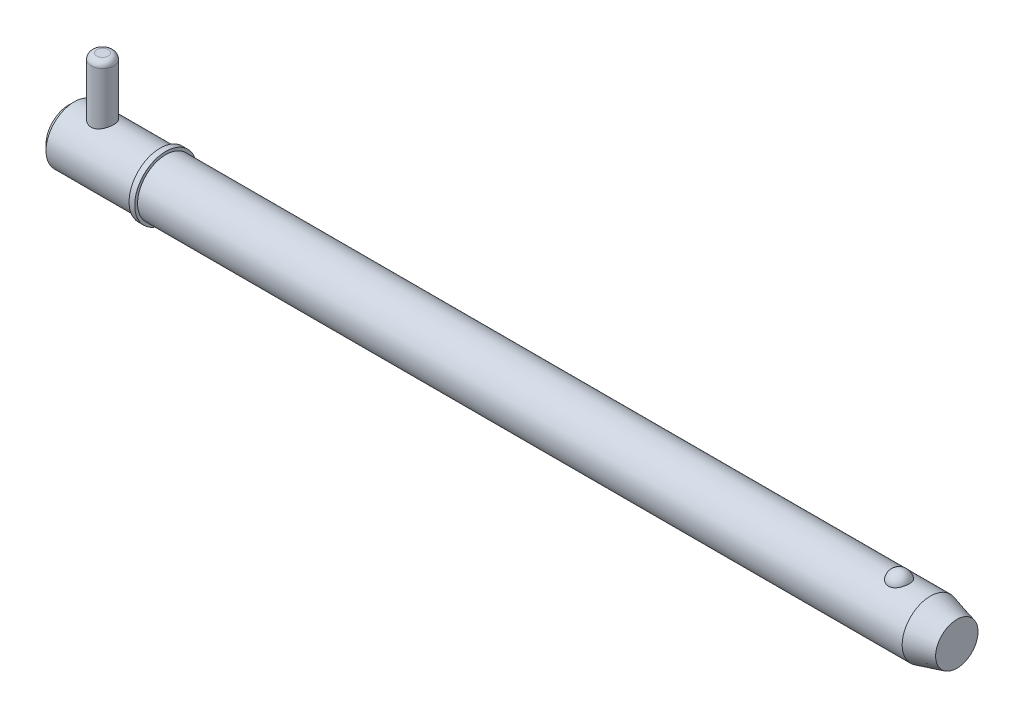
ISO-10303-21;
HEADER;
FILE_DESCRIPTION(('STEP AP214'),'2;1');
FILE_NAME('part.step','',(''),(''),'','','');
FILE_SCHEMA(('AUTOMOTIVE_DESIGN { 1 0 10303 214 1 1 1 1 }'));
ENDSEC;
DATA;
#1=APPLICATION_CONTEXT('core data for automotive mechanical design processes');
#2=APPLICATION_PROTOCOL_DEFINITION('international standard','automotive_design',2000,#1);
#3=PRODUCT_CONTEXT('',#1,'mechanical');
#4=PRODUCT('Part','Part','',(#3));
#5=PRODUCT_RELATED_PRODUCT_CATEGORY('part','',(#4));
#6=PRODUCT_DEFINITION_FORMATION('','',#4);
#7=PRODUCT_DEFINITION_CONTEXT('part definition',#1,'design');
#8=PRODUCT_DEFINITION('design','',#6,#7);
#9=PRODUCT_DEFINITION_SHAPE('','',#8);
#10=(LENGTH_UNIT() NAMED_UNIT(*) SI_UNIT(.MILLI.,.METRE.));
#11=(NAMED_UNIT(*) PLANE_ANGLE_UNIT() SI_UNIT($,.RADIAN.));
#12=(NAMED_UNIT(*) SI_UNIT($,.STERADIAN.) SOLID_ANGLE_UNIT());
#13=UNCERTAINTY_MEASURE_WITH_UNIT(LENGTH_MEASURE(1.E-05),#10,'distance_accuracy_value','');
#14=(GEOMETRIC_REPRESENTATION_CONTEXT(3) GLOBAL_UNCERTAINTY_ASSIGNED_CONTEXT((#13)) GLOBAL_UNIT_ASSIGNED_CONTEXT((#10,
#11,#12)) REPRESENTATION_CONTEXT('',''));
#15=CARTESIAN_POINT('',(0.,0.,0.));
#16=DIRECTION('',(0.,0.,1.));
#17=DIRECTION('',(1.,0.,0.));
#18=AXIS2_PLACEMENT_3D('',#15,#16,#17);
#19=CARTESIAN_POINT('',(9.525,23.81,0.));
#20=DIRECTION('',(0.,-1.,0.));
#21=DIRECTION('',(0.,0.,-1.));
#22=AXIS2_PLACEMENT_3D('',#19,#20,#21);
#23=CYLINDRICAL_SURFACE('',#22,3.175);
#24=CARTESIAN_POINT('',(9.525,-6.3525,0.));
#25=DIRECTION('',(0.,1.,0.));
#26=DIRECTION('',(0.,0.,1.));
#27=AXIS2_PLACEMENT_3D('',#24,#25,#26);
#28=CIRCLE('',#27,3.175);
#29=CARTESIAN_POINT('',(9.525,-6.3525,3.175));
#30=VERTEX_POINT('',#29);
#31=EDGE_CURVE('P0_E25',#30,#30,#28,.T.);
#32=ORIENTED_EDGE('',*,*,#31,.T.);
#33=EDGE_LOOP('',(#32));
#34=FACE_BOUND('',#33,.T.);
#35=CARTESIAN_POINT('',(9.525,22.2225,0.));
#36=DIRECTION('',(0.,1.,0.));
#37=DIRECTION('',(0.,0.,1.));
#38=AXIS2_PLACEMENT_3D('',#35,#36,#37);
#39=CIRCLE('',#38,3.175);
#40=CARTESIAN_POINT('',(9.525,22.2225,3.175));
#41=VERTEX_POINT('',#40);
#42=EDGE_CURVE('P0_E29',#41,#41,#39,.F.);
#43=ORIENTED_EDGE('',*,*,#42,.T.);
#44=EDGE_LOOP('',(#43));
#45=FACE_BOUND('',#44,.T.);
#46=ADVANCED_FACE('P0_F14',(#34,#45),#23,.T.);
#47=CARTESIAN_POINT('',(9.525,23.81,0.));
#48=DIRECTION('',(0.,1.,0.));
#49=DIRECTION('',(0.,0.,1.));
#50=AXIS2_PLACEMENT_3D('',#47,#48,#49);
#51=PLANE('',#50);
#52=CARTESIAN_POINT('',(9.525,23.81,0.));
#53=DIRECTION('',(0.,1.,0.));
#54=DIRECTION('',(0.,0.,1.));
#55=AXIS2_PLACEMENT_3D('',#52,#53,#54);
#56=CIRCLE('',#55,1.5875);
#57=CARTESIAN_POINT('',(9.525,23.81,1.5875));
#58=VERTEX_POINT('',#57);
#59=EDGE_CURVE('P0_E10',#58,#58,#56,.T.);
#60=ORIENTED_EDGE('',*,*,#59,.T.);
#61=EDGE_LOOP('',(#60));
#62=FACE_BOUND('',#61,.T.);
#63=ADVANCED_FACE('P0_F46',(#62),#51,.T.);
#64=CARTESIAN_POINT('',(9.525,-7.94,0.));
#65=DIRECTION('',(0.,1.,0.));
#66=DIRECTION('',(0.,0.,1.));
#67=AXIS2_PLACEMENT_3D('',#64,#65,#66);
#68=PLANE('',#67);
#69=CARTESIAN_POINT('',(9.525,-7.94,0.));
#70=DIRECTION('',(0.,1.,0.));
#71=DIRECTION('',(0.,0.,1.));
#72=AXIS2_PLACEMENT_3D('',#69,#70,#71);
#73=CIRCLE('',#72,1.5875);
#74=CARTESIAN_POINT('',(9.525,-7.94,1.5875));
#75=VERTEX_POINT('',#74);
#76=EDGE_CURVE('P0_E21',#75,#75,#73,.F.);
#77=ORIENTED_EDGE('',*,*,#76,.T.);
#78=EDGE_LOOP('',(#77));
#79=FACE_BOUND('',#78,.T.);
#80=ADVANCED_FACE('P0_F43',(#79),#68,.F.);
#81=CARTESIAN_POINT('',(9.525,-6.3525,0.));
#82=DIRECTION('',(0.,1.,0.));
#83=DIRECTION('',(0.,0.,1.));
#84=AXIS2_PLACEMENT_3D('',#81,#82,#83);
#85=DEGENERATE_TOROIDAL_SURFACE('',#84,1.5875,1.5875,.T.);
#86=ORIENTED_EDGE('',*,*,#76,.F.);
#87=EDGE_LOOP('',(#86));
#88=FACE_BOUND('',#87,.T.);
#89=ORIENTED_EDGE('',*,*,#31,.F.);
#90=EDGE_LOOP('',(#89));
#91=FACE_BOUND('',#90,.T.);
#92=ADVANCED_FACE('P0_F38',(#88,#91),#85,.T.);
#93=CARTESIAN_POINT('',(9.525,22.2225,0.));
#94=DIRECTION('',(0.,1.,0.));
#95=DIRECTION('',(0.,0.,1.));
#96=AXIS2_PLACEMENT_3D('',#93,#94,#95);
#97=DEGENERATE_TOROIDAL_SURFACE('',#96,1.5875,1.5875,.T.);
#98=ORIENTED_EDGE('',*,*,#42,.F.);
#99=EDGE_LOOP('',(#98));
#100=FACE_BOUND('',#99,.T.);
#101=ORIENTED_EDGE('',*,*,#59,.F.);
#102=EDGE_LOOP('',(#101));
#103=FACE_BOUND('',#102,.T.);
#104=ADVANCED_FACE('P0_F16',(#100,#103),#97,.T.);
#105=CLOSED_SHELL('',(#46,#63,#80,#92,#104));
#106=MANIFOLD_SOLID_BREP('P0_B1',#105);
#107=CARTESIAN_POINT('',(0.,0.,0.));
#108=DIRECTION('',(1.,0.,0.));
#109=DIRECTION('',(0.,0.,-1.));
#110=AXIS2_PLACEMENT_3D('',#107,#108,#109);
#111=CYLINDRICAL_SURFACE('',#110,7.94);
#112=CARTESIAN_POINT('',(242.151879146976,0.,0.));
#113=DIRECTION('',(1.,0.,0.));
#114=DIRECTION('',(0.,0.,-1.));
#115=AXIS2_PLACEMENT_3D('',#112,#113,#114);
#116=CIRCLE('',#115,7.94);
#117=CARTESIAN_POINT('',(242.151879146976,0.,-7.94));
#118=VERTEX_POINT('',#117);
#119=EDGE_CURVE('P1_E81',#118,#118,#116,.T.);
#120=ORIENTED_EDGE('',*,*,#119,.F.);
#121=EDGE_LOOP('',(#120));
#122=FACE_BOUND('',#121,.T.);
#123=CARTESIAN_POINT('',(27.31,0.,0.));
#124=DIRECTION('',(1.,0.,0.));
#125=DIRECTION('',(0.,0.,-1.));
#126=AXIS2_PLACEMENT_3D('',#123,#124,#125);
#127=CIRCLE('',#126,7.94);
#128=CARTESIAN_POINT('',(27.31,0.,-7.94));
#129=VERTEX_POINT('',#128);
#130=EDGE_CURVE('P1_E85',#129,#129,#127,.T.);
#131=ORIENTED_EDGE('',*,*,#130,.T.);
#132=EDGE_LOOP('',(#131));
#133=FACE_BOUND('',#132,.T.);
#134=CARTESIAN_POINT('',(233.344907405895,7.37767842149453,2.93486986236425));
#135=CARTESIAN_POINT('',(233.192749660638,7.37767329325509,2.93487505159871));
#136=CARTESIAN_POINT('',(233.040632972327,7.38258419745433,2.92262454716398));
#137=CARTESIAN_POINT('',(232.740928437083,7.40163229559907,2.87404196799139));
#138=CARTESIAN_POINT('',(232.593339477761,7.41576720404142,2.83771585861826));
#139=CARTESIAN_POINT('',(232.307018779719,7.45161576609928,2.74218769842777));
#140=CARTESIAN_POINT('',(232.168274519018,7.47331841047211,2.68301886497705));
#141=CARTESIAN_POINT('',(231.902882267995,7.52194082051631,2.54350967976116));
#142=CARTESIAN_POINT('',(231.776236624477,7.54886159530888,2.463165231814));
#143=CARTESIAN_POINT('',(231.534534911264,7.60594671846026,2.28090375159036));
#144=CARTESIAN_POINT('',(231.419906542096,7.63618114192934,2.17844211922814));
#145=CARTESIAN_POINT('',(231.208878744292,7.6961404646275,1.956084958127));
#146=CARTESIAN_POINT('',(231.112482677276,7.72586526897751,1.8361862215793));
#147=CARTESIAN_POINT('',(230.935938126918,7.78314821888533,1.5762808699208));
#148=CARTESIAN_POINT('',(230.856707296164,7.81055035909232,1.43561546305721));
#149=CARTESIAN_POINT('',(230.721797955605,7.85879631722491,1.14236334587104));
#150=CARTESIAN_POINT('',(230.666121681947,7.87963951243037,0.989775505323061));
#151=CARTESIAN_POINT('',(230.57881215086,7.91289645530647,0.674619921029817));
#152=CARTESIAN_POINT('',(230.54753090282,7.92518652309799,0.511941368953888));
#153=CARTESIAN_POINT('',(230.510975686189,7.93958930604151,0.183247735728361));
#154=CARTESIAN_POINT('',(230.505701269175,7.94170219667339,0.0172327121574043));
#155=CARTESIAN_POINT('',(230.521231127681,7.93554931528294,-0.312672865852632));
#156=CARTESIAN_POINT('',(230.541925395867,7.92732732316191,-0.476569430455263));
#157=CARTESIAN_POINT('',(230.60878655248,7.90141534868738,-0.7983052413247));
#158=CARTESIAN_POINT('',(230.654953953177,7.88372517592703,-0.956144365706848));
#159=CARTESIAN_POINT('',(230.771898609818,7.84066230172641,-1.26152073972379));
#160=CARTESIAN_POINT('',(230.842704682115,7.81528060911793,-1.40904568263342));
#161=CARTESIAN_POINT('',(231.007478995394,7.75948672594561,-1.68950598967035));
#162=CARTESIAN_POINT('',(231.101448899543,7.72907417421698,-1.82244030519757));
#163=CARTESIAN_POINT('',(231.310839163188,7.66640424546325,-2.07032792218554));
#164=CARTESIAN_POINT('',(231.426315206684,7.63414223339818,-2.1852330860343));
#165=CARTESIAN_POINT('',(231.6759006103,7.57149681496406,-2.39329737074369));
#166=CARTESIAN_POINT('',(231.810008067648,7.54111321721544,-2.48645870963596));
#167=CARTESIAN_POINT('',(232.090111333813,7.48650742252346,-2.64628132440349));
#168=CARTESIAN_POINT('',(232.235760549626,7.46215900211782,-2.71350554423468));
#169=CARTESIAN_POINT('',(232.537425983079,7.42171253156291,-2.82226614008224));
#170=CARTESIAN_POINT('',(232.693438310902,7.40561140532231,-2.86381209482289));
#171=CARTESIAN_POINT('',(233.002970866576,7.38426796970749,-2.91839077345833));
#172=CARTESIAN_POINT('',(233.156222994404,7.37852109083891,-2.93275024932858));
#173=CARTESIAN_POINT('',(233.463070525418,7.37700973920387,-2.93655208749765));
#174=CARTESIAN_POINT('',(233.616665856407,7.38124333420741,-2.925999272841));
#175=CARTESIAN_POINT('',(233.914990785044,7.39890635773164,-2.88102897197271));
#176=CARTESIAN_POINT('',(234.059848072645,7.41205491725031,-2.84733999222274));
#177=CARTESIAN_POINT('',(234.34164329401,7.44580110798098,-2.75788206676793));
#178=CARTESIAN_POINT('',(234.478580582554,7.46639934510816,-2.70211132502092));
#179=CARTESIAN_POINT('',(234.744061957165,7.51339098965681,-2.56858908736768));
#180=CARTESIAN_POINT('',(234.872354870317,7.5399020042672,-2.49038067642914));
#181=CARTESIAN_POINT('',(235.114244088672,7.59569503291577,-2.31462737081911));
#182=CARTESIAN_POINT('',(235.227837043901,7.62497767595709,-2.21707808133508));
#183=CARTESIAN_POINT('',(235.44322156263,7.68489473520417,-1.99982049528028));
#184=CARTESIAN_POINT('',(235.544148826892,7.7155241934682,-1.8792533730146));
#185=CARTESIAN_POINT('',(235.725186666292,7.77353016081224,-1.62268826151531));
#186=CARTESIAN_POINT('',(235.805293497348,7.80090608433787,-1.48668750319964));
#187=CARTESIAN_POINT('',(235.945361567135,7.85047992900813,-1.19818413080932));
#188=CARTESIAN_POINT('',(236.004587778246,7.87248183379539,-1.04529016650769));
#189=CARTESIAN_POINT('',(236.097982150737,7.90785114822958,-0.731080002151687));
#190=CARTESIAN_POINT('',(236.132149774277,7.92121837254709,-0.569763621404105));
#191=CARTESIAN_POINT('',(236.174795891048,7.93797834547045,-0.242812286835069));
#192=CARTESIAN_POINT('',(236.183204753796,7.94134405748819,-0.0771668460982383));
#193=CARTESIAN_POINT('',(236.173962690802,7.93767937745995,0.253276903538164));
#194=CARTESIAN_POINT('',(236.156312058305,7.93064910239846,0.418075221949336));
#195=CARTESIAN_POINT('',(236.095424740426,7.90695571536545,0.741525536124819));
#196=CARTESIAN_POINT('',(236.052281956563,7.8903279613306,0.900197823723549));
#197=CARTESIAN_POINT('',(235.94135358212,7.84916386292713,1.20759654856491));
#198=CARTESIAN_POINT('',(235.87356656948,7.82462706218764,1.35632241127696));
#199=CARTESIAN_POINT('',(235.714371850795,7.77006699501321,1.64032869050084));
#200=CARTESIAN_POINT('',(235.622861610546,7.74002008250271,1.7755471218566));
#201=CARTESIAN_POINT('',(235.418296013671,7.67774175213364,2.0280064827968));
#202=CARTESIAN_POINT('',(235.305241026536,7.64551037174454,2.14524772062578));
#203=CARTESIAN_POINT('',(235.060831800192,7.58265895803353,2.35778002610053));
#204=CARTESIAN_POINT('',(234.929583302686,7.5520309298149,2.45319004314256));
#205=CARTESIAN_POINT('',(234.651601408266,7.49579792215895,2.61999897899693));
#206=CARTESIAN_POINT('',(234.504867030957,7.47019326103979,2.69139637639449));
#207=CARTESIAN_POINT('',(234.192947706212,7.42622216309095,2.81053241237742));
#208=CARTESIAN_POINT('',(234.027220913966,7.40825002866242,2.85700910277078));
#209=CARTESIAN_POINT('',(233.689279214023,7.38398348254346,2.91916850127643));
#210=CARTESIAN_POINT('',(233.51706702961,7.37768422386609,2.93486399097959));
#211=CARTESIAN_POINT('',(233.344907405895,7.37767842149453,2.93486986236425));
#212=B_SPLINE_CURVE_WITH_KNOTS('',3,(#134,#135,#136,#137,#138,#139,#140,#141,#142,#143,#144,
#145,#146,#147,#148,#149,#150,#151,#152,#153,#154,#155,#156,#157,#158,#159,#160,#161,#162,#163,
#164,#165,#166,#167,#168,#169,#170,#171,#172,#173,#174,#175,#176,#177,#178,#179,#180,#181,#182,
#183,#184,#185,#186,#187,#188,#189,#190,#191,#192,#193,#194,#195,#196,#197,#198,#199,#200,#201,
#202,#203,#204,#205,#206,#207,#208,#209,#210,#211),.UNSPECIFIED.,.T.,.F.,(4,2,2,2,2,2,2,2,2,2,2,
2,2,2,2,2,2,2,2,2,2,2,2,2,2,2,2,2,2,2,2,2,2,2,2,2,2,2,4),(0.,0.455841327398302,
0.911569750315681,1.36663794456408,1.82179423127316,2.28978983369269,2.75787163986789,
3.24685368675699,3.73588214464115,4.23184282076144,4.7277949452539,5.22165321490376,
5.71552141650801,6.20996917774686,6.70445245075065,7.20023431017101,7.69596557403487,
8.1802341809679,8.6643220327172,9.12410697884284,9.58380291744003,10.0296503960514,
10.475534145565,10.9312349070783,11.3870393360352,11.8654416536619,12.3439299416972,
12.8378875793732,13.3318558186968,13.8271581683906,14.3224549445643,14.8159385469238,
15.3094506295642,15.8051323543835,16.3008055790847,16.7937101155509,17.2866458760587,
17.8026240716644,18.3183879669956),.UNSPECIFIED.);
#213=CARTESIAN_POINT('',(233.344907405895,7.37767842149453,2.93486986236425));
#214=VERTEX_POINT('',#213);
#215=EDGE_CURVE('P1_E35',#214,#214,#212,.T.);
#216=ORIENTED_EDGE('',*,*,#215,.T.);
#217=EDGE_LOOP('',(#216));
#218=FACE_BOUND('',#217,.T.);
#219=ADVANCED_FACE('P1_F13',(#122,#133,#218),#111,.T.);
#220=CARTESIAN_POINT('',(0.,0.,0.));
#221=DIRECTION('',(-1.,0.,0.));
#222=DIRECTION('',(0.,0.,1.));
#223=AXIS2_PLACEMENT_3D('',#220,#221,#222);
#224=PLANE('',#223);
#225=CARTESIAN_POINT('',(0.,0.,0.));
#226=DIRECTION('',(1.,0.,0.));
#227=DIRECTION('',(0.,0.,-1.));
#228=AXIS2_PLACEMENT_3D('',#225,#226,#227);
#229=CIRCLE('',#228,6.352);
#230=CARTESIAN_POINT('',(0.,0.,-6.352));
#231=VERTEX_POINT('',#230);
#232=EDGE_CURVE('P1_E9',#231,#231,#229,.T.);
#233=ORIENTED_EDGE('',*,*,#232,.F.);
#234=EDGE_LOOP('',(#233));
#235=FACE_BOUND('',#234,.T.);
#236=ADVANCED_FACE('P1_F15',(#235),#224,.T.);
#237=CARTESIAN_POINT('',(1.58799999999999,0.,0.));
#238=DIRECTION('',(1.,0.,0.));
#239=DIRECTION('',(0.,0.,-1.));
#240=AXIS2_PLACEMENT_3D('',#237,#238,#239);
#241=CONICAL_SURFACE('',#240,7.94,0.78539816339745);
#242=ORIENTED_EDGE('',*,*,#232,.T.);
#243=EDGE_LOOP('',(#242));
#244=FACE_BOUND('',#243,.T.);
#245=CARTESIAN_POINT('',(1.58799999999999,0.,0.));
#246=DIRECTION('',(1.,0.,0.));
#247=DIRECTION('',(0.,0.,-1.));
#248=AXIS2_PLACEMENT_3D('',#245,#246,#247);
#249=CIRCLE('',#248,7.94);
#250=CARTESIAN_POINT('',(1.58799999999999,0.,-7.94));
#251=VERTEX_POINT('',#250);
#252=EDGE_CURVE('P1_E26',#251,#251,#249,.T.);
#253=ORIENTED_EDGE('',*,*,#252,.F.);
#254=EDGE_LOOP('',(#253));
#255=FACE_BOUND('',#254,.T.);
#256=ADVANCED_FACE('P1_F77',(#244,#255),#241,.T.);
#257=CARTESIAN_POINT('',(0.,0.,0.));
#258=DIRECTION('',(1.,0.,0.));
#259=DIRECTION('',(0.,0.,-1.));
#260=AXIS2_PLACEMENT_3D('',#257,#258,#259);
#261=CYLINDRICAL_SURFACE('',#260,7.94);
#262=CARTESIAN_POINT('',(9.525,-7.27756655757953,3.175));
#263=CARTESIAN_POINT('',(9.43992346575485,-7.27756715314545,3.17499935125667));
#264=CARTESIAN_POINT('',(9.35481882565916,-7.27906496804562,3.1715736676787));
#265=CARTESIAN_POINT('',(9.18524505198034,-7.28499816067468,3.15791803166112));
#266=CARTESIAN_POINT('',(9.100776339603,-7.28943533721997,3.14768391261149));
#267=CARTESIAN_POINT('',(8.84895715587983,-7.30698881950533,3.10684226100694));
#268=CARTESIAN_POINT('',(8.6834173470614,-7.32434654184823,3.06609574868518));
#269=CARTESIAN_POINT('',(8.36278910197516,-7.36806950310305,2.95945910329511));
#270=CARTESIAN_POINT('',(8.20766386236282,-7.39440078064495,2.89366366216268));
#271=CARTESIAN_POINT('',(7.91065319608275,-7.45304562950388,2.73907413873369));
#272=CARTESIAN_POINT('',(7.76876488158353,-7.48535789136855,2.65028508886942));
#273=CARTESIAN_POINT('',(7.49411086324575,-7.55439482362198,2.44679888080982));
#274=CARTESIAN_POINT('',(7.36219910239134,-7.59126138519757,2.33099745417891));
#275=CARTESIAN_POINT('',(7.11904234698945,-7.66408045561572,2.07909838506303));
#276=CARTESIAN_POINT('',(7.00780457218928,-7.70003264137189,1.94299368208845));
#277=CARTESIAN_POINT('',(6.80492173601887,-7.76867514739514,1.64775981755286));
#278=CARTESIAN_POINT('',(6.71422139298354,-7.80118112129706,1.48793473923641));
#279=CARTESIAN_POINT('',(6.56135788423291,-7.85754918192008,1.15376269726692));
#280=CARTESIAN_POINT('',(6.49918311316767,-7.88141478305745,0.979421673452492));
#281=CARTESIAN_POINT('',(6.40818142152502,-7.91680873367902,0.630115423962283));
#282=CARTESIAN_POINT('',(6.3778864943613,-7.9288781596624,0.455588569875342));
#283=CARTESIAN_POINT('',(6.34677743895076,-7.94127547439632,0.103539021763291));
#284=CARTESIAN_POINT('',(6.34595232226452,-7.94160773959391,-0.0739825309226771));
#285=CARTESIAN_POINT('',(6.37300128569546,-7.93082261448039,-0.416371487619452));
#286=CARTESIAN_POINT('',(6.39926693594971,-7.92034690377,-0.581389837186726));
#287=CARTESIAN_POINT('',(6.47701615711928,-7.88998770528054,-0.904449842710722));
#288=CARTESIAN_POINT('',(6.52850157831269,-7.87010352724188,-1.06249098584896));
#289=CARTESIAN_POINT('',(6.65586120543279,-7.82249343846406,-1.36995769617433));
#290=CARTESIAN_POINT('',(6.73209124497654,-7.79465387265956,-1.51921754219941));
#291=CARTESIAN_POINT('',(6.90644286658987,-7.73389606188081,-1.80321183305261));
#292=CARTESIAN_POINT('',(7.00457194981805,-7.70097607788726,-1.93794127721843));
#293=CARTESIAN_POINT('',(7.22744086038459,-7.63084889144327,-2.19843606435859));
#294=CARTESIAN_POINT('',(7.35350432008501,-7.59350211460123,-2.3230330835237));
#295=CARTESIAN_POINT('',(7.62488266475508,-7.52039654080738,-2.54979642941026));
#296=CARTESIAN_POINT('',(7.77020381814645,-7.48463826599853,-2.65195542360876));
#297=CARTESIAN_POINT('',(8.08119298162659,-7.41780943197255,-2.83361305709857));
#298=CARTESIAN_POINT('',(8.24731937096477,-7.38689959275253,-2.91239105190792));
#299=CARTESIAN_POINT('',(8.59204539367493,-7.33515216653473,-3.04038913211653));
#300=CARTESIAN_POINT('',(8.77063684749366,-7.31430804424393,-3.08962840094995));
#301=CARTESIAN_POINT('',(9.12356982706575,-7.28663831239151,-3.15431018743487));
#302=CARTESIAN_POINT('',(9.29750494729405,-7.2790344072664,-3.17163284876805));
#303=CARTESIAN_POINT('',(9.64592502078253,-7.27648884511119,-3.17747282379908));
#304=CARTESIAN_POINT('',(9.82040979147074,-7.28154335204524,-3.16599886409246));
#305=CARTESIAN_POINT('',(10.1545374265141,-7.30294638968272,-3.11628310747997));
#306=CARTESIAN_POINT('',(10.3144598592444,-7.31863587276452,-3.0796016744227));
#307=CARTESIAN_POINT('',(10.625774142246,-7.35872371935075,-2.98253618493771));
#308=CARTESIAN_POINT('',(10.7771640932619,-7.38312401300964,-2.92214687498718));
#309=CARTESIAN_POINT('',(11.0739599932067,-7.4390944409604,-2.77664664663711));
#310=CARTESIAN_POINT('',(11.2188745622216,-7.47091513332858,-2.69063278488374));
#311=CARTESIAN_POINT('',(11.4928722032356,-7.53775867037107,-2.49724834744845));
#312=CARTESIAN_POINT('',(11.6219487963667,-7.57278281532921,-2.38986907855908));
#313=CARTESIAN_POINT('',(11.8705091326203,-7.64520845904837,-2.1474449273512));
#314=CARTESIAN_POINT('',(11.9885816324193,-7.68259462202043,-2.01094304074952));
#315=CARTESIAN_POINT('',(12.2003631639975,-7.75309951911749,-1.71917041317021));
#316=CARTESIAN_POINT('',(12.2940712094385,-7.78621808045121,-1.56389891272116));
#317=CARTESIAN_POINT('',(12.4541161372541,-7.84456050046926,-1.23845027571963));
#318=CARTESIAN_POINT('',(12.5204600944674,-7.86978639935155,-1.06827700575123));
#319=CARTESIAN_POINT('',(12.6231407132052,-7.90943635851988,-0.717928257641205));
#320=CARTESIAN_POINT('',(12.6594936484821,-7.92386627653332,-0.537758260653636));
#321=CARTESIAN_POINT('',(12.6992281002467,-7.93967263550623,-0.185201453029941));
#322=CARTESIAN_POINT('',(12.7046050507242,-7.94183891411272,-0.0130732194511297));
#323=CARTESIAN_POINT('',(12.6875036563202,-7.9350072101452,0.329549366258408));
#324=CARTESIAN_POINT('',(12.6650295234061,-7.92601091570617,0.500043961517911));
#325=CARTESIAN_POINT('',(12.5942896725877,-7.89825976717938,0.829196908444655));
#326=CARTESIAN_POINT('',(12.5468364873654,-7.87981280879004,0.988057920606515));
#327=CARTESIAN_POINT('',(12.4283390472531,-7.83513565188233,1.29553461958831));
#328=CARTESIAN_POINT('',(12.3572904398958,-7.8089040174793,1.44414841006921));
#329=CARTESIAN_POINT('',(12.1900822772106,-7.7497911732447,1.73412879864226));
#330=CARTESIAN_POINT('',(12.0929519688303,-7.71666737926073,1.87488510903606));
#331=CARTESIAN_POINT('',(11.8777894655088,-7.64775894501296,2.13869231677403));
#332=CARTESIAN_POINT('',(11.7597486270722,-7.61197320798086,2.26173585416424));
#333=CARTESIAN_POINT('',(11.4974896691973,-7.53902341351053,2.49449755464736));
#334=CARTESIAN_POINT('',(11.3521039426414,-7.50191102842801,2.60292060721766));
#335=CARTESIAN_POINT('',(11.0440201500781,-7.43289551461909,2.79392602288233));
#336=CARTESIAN_POINT('',(10.8813200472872,-7.40099299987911,2.87650534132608));
#337=CARTESIAN_POINT('',(10.558064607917,-7.3489506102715,3.00682739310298));
#338=CARTESIAN_POINT('',(10.398627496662,-7.32801197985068,3.05703164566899));
#339=CARTESIAN_POINT('',(10.0731242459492,-7.29639491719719,3.13175843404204));
#340=CARTESIAN_POINT('',(9.90707793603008,-7.28568789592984,3.15635254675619));
#341=CARTESIAN_POINT('',(9.70441566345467,-7.27968826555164,3.17013149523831));
#342=CARTESIAN_POINT('',(9.66856669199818,-7.27889378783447,3.17195593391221));
#343=CARTESIAN_POINT('',(9.59681348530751,-7.27783278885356,3.17439036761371));
#344=CARTESIAN_POINT('',(9.56090924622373,-7.27756630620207,3.17500027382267));
#345=CARTESIAN_POINT('',(9.525,-7.27756655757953,3.175));
#346=B_SPLINE_CURVE_WITH_KNOTS('',3,(#262,#263,#264,#265,#266,#267,#268,#269,#270,#271,#272,
#273,#274,#275,#276,#277,#278,#279,#280,#281,#282,#283,#284,#285,#286,#287,#288,#289,#290,#291,
#292,#293,#294,#295,#296,#297,#298,#299,#300,#301,#302,#303,#304,#305,#306,#307,#308,#309,#310,
#311,#312,#313,#314,#315,#316,#317,#318,#319,#320,#321,#322,#323,#324,#325,#326,#327,#328,#329,
#330,#331,#332,#333,#334,#335,#336,#337,#338,#339,#340,#341,#342,#343,#344,#345),.UNSPECIFIED.,
.T.,.F.,(4,2,2,2,2,2,2,2,2,2,2,2,2,2,2,2,2,2,2,2,2,2,2,2,2,2,2,2,2,2,2,2,2,2,2,2,2,2,2,2,2,4),
(0.,0.255187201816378,0.510530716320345,1.0218798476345,1.53131482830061,2.04063840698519,
2.57635929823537,3.11226692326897,3.66929090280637,4.22608806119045,4.75594400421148,
5.28560237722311,5.78552836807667,6.28549104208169,6.79298787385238,7.30065880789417,
7.8416422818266,8.38280228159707,8.93923025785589,9.49529647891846,10.0174074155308,
10.5393601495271,11.0316114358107,11.5239718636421,12.0362920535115,12.5488211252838,
13.0991799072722,13.6495609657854,14.1997996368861,14.7497395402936,15.2638187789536,
15.7778202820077,16.2760504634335,16.7743726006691,17.294711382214,17.8152657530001,
18.3680208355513,18.9208410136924,19.4240423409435,19.9258334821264,20.0335354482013,
20.1412452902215),.UNSPECIFIED.);
#347=CARTESIAN_POINT('',(9.525,-7.27756655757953,3.175));
#348=VERTEX_POINT('',#347);
#349=EDGE_CURVE('P1_E17',#348,#348,#346,.T.);
#350=ORIENTED_EDGE('',*,*,#349,.F.);
#351=EDGE_LOOP('',(#350));
#352=FACE_BOUND('',#351,.T.);
#353=CARTESIAN_POINT('',(9.525,7.27756655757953,3.175));
#354=CARTESIAN_POINT('',(9.61007653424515,7.27756715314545,3.17499935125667));
#355=CARTESIAN_POINT('',(9.69518117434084,7.27906496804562,3.1715736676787));
#356=CARTESIAN_POINT('',(9.86475494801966,7.28499816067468,3.15791803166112));
#357=CARTESIAN_POINT('',(9.949223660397,7.28943533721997,3.14768391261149));
#358=CARTESIAN_POINT('',(10.2010428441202,7.30698881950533,3.10684226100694));
#359=CARTESIAN_POINT('',(10.3665826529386,7.32434654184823,3.06609574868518));
#360=CARTESIAN_POINT('',(10.6872108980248,7.36806950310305,2.95945910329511));
#361=CARTESIAN_POINT('',(10.8423361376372,7.39440078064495,2.89366366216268));
#362=CARTESIAN_POINT('',(11.1393468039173,7.45304562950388,2.73907413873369));
#363=CARTESIAN_POINT('',(11.2812351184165,7.48535789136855,2.65028508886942));
#364=CARTESIAN_POINT('',(11.5558891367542,7.55439482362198,2.44679888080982));
#365=CARTESIAN_POINT('',(11.6878008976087,7.59126138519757,2.33099745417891));
#366=CARTESIAN_POINT('',(11.9309576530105,7.66408045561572,2.07909838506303));
#367=CARTESIAN_POINT('',(12.0421954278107,7.70003264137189,1.94299368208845));
#368=CARTESIAN_POINT('',(12.2450782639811,7.76867514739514,1.64775981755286));
#369=CARTESIAN_POINT('',(12.3357786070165,7.80118112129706,1.48793473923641));
#370=CARTESIAN_POINT('',(12.4886421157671,7.85754918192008,1.15376269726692));
#371=CARTESIAN_POINT('',(12.5508168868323,7.88141478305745,0.979421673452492));
#372=CARTESIAN_POINT('',(12.641818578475,7.91680873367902,0.630115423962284));
#373=CARTESIAN_POINT('',(12.6721135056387,7.9288781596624,0.455588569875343));
#374=CARTESIAN_POINT('',(12.7032225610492,7.94127547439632,0.103539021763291));
#375=CARTESIAN_POINT('',(12.7040476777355,7.94160773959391,-0.0739825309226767));
#376=CARTESIAN_POINT('',(12.6769987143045,7.93082261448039,-0.416371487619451));
#377=CARTESIAN_POINT('',(12.6507330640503,7.92034690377,-0.581389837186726));
#378=CARTESIAN_POINT('',(12.5729838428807,7.88998770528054,-0.904449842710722));
#379=CARTESIAN_POINT('',(12.5214984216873,7.87010352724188,-1.06249098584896));
#380=CARTESIAN_POINT('',(12.3941387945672,7.82249343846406,-1.36995769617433));
#381=CARTESIAN_POINT('',(12.3179087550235,7.79465387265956,-1.51921754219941));
#382=CARTESIAN_POINT('',(12.1435571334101,7.73389606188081,-1.80321183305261));
#383=CARTESIAN_POINT('',(12.0454280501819,7.70097607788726,-1.93794127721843));
#384=CARTESIAN_POINT('',(11.8225591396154,7.63084889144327,-2.19843606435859));
#385=CARTESIAN_POINT('',(11.696495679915,7.59350211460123,-2.3230330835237));
#386=CARTESIAN_POINT('',(11.4251173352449,7.52039654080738,-2.54979642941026));
#387=CARTESIAN_POINT('',(11.2797961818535,7.48463826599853,-2.65195542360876));
#388=CARTESIAN_POINT('',(10.9688070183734,7.41780943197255,-2.83361305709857));
#389=CARTESIAN_POINT('',(10.8026806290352,7.38689959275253,-2.91239105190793));
#390=CARTESIAN_POINT('',(10.4579546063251,7.33515216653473,-3.04038913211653));
#391=CARTESIAN_POINT('',(10.2793631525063,7.31430804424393,-3.08962840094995));
#392=CARTESIAN_POINT('',(9.92643017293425,7.28663831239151,-3.15431018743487));
#393=CARTESIAN_POINT('',(9.75249505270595,7.2790344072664,-3.17163284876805));
#394=CARTESIAN_POINT('',(9.40407497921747,7.2764888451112,-3.17747282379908));
#395=CARTESIAN_POINT('',(9.22959020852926,7.28154335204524,-3.16599886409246));
#396=CARTESIAN_POINT('',(8.89546257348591,7.30294638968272,-3.11628310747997));
#397=CARTESIAN_POINT('',(8.73554014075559,7.31863587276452,-3.0796016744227));
#398=CARTESIAN_POINT('',(8.42422585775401,7.35872371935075,-2.98253618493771));
#399=CARTESIAN_POINT('',(8.27283590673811,7.38312401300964,-2.92214687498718));
#400=CARTESIAN_POINT('',(7.97604000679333,7.4390944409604,-2.77664664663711));
#401=CARTESIAN_POINT('',(7.83112543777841,7.47091513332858,-2.69063278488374));
#402=CARTESIAN_POINT('',(7.55712779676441,7.53775867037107,-2.49724834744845));
#403=CARTESIAN_POINT('',(7.42805120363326,7.57278281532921,-2.38986907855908));
#404=CARTESIAN_POINT('',(7.17949086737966,7.64520845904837,-2.1474449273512));
#405=CARTESIAN_POINT('',(7.06141836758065,7.68259462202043,-2.01094304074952));
#406=CARTESIAN_POINT('',(6.8496368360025,7.75309951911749,-1.71917041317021));
#407=CARTESIAN_POINT('',(6.75592879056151,7.78621808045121,-1.56389891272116));
#408=CARTESIAN_POINT('',(6.59588386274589,7.84456050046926,-1.23845027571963));
#409=CARTESIAN_POINT('',(6.52953990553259,7.86978639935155,-1.06827700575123));
#410=CARTESIAN_POINT('',(6.42685928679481,7.90943635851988,-0.717928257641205));
#411=CARTESIAN_POINT('',(6.39050635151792,7.92386627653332,-0.537758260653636));
#412=CARTESIAN_POINT('',(6.35077189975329,7.93967263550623,-0.18520145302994));
#413=CARTESIAN_POINT('',(6.34539494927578,7.94183891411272,-0.0130732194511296));
#414=CARTESIAN_POINT('',(6.36249634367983,7.9350072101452,0.329549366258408));
#415=CARTESIAN_POINT('',(6.38497047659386,7.92601091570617,0.500043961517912));
#416=CARTESIAN_POINT('',(6.45571032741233,7.89825976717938,0.829196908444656));
#417=CARTESIAN_POINT('',(6.50316351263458,7.87981280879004,0.988057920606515));
#418=CARTESIAN_POINT('',(6.62166095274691,7.83513565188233,1.29553461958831));
#419=CARTESIAN_POINT('',(6.69270956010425,7.8089040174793,1.44414841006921));
#420=CARTESIAN_POINT('',(6.85991772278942,7.7497911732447,1.73412879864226));
#421=CARTESIAN_POINT('',(6.95704803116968,7.71666737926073,1.87488510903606));
#422=CARTESIAN_POINT('',(7.17221053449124,7.64775894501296,2.13869231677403));
#423=CARTESIAN_POINT('',(7.29025137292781,7.61197320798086,2.26173585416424));
#424=CARTESIAN_POINT('',(7.55251033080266,7.53902341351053,2.49449755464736));
#425=CARTESIAN_POINT('',(7.69789605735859,7.50191102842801,2.60292060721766));
#426=CARTESIAN_POINT('',(8.00597984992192,7.43289551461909,2.79392602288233));
#427=CARTESIAN_POINT('',(8.16867995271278,7.40099299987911,2.87650534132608));
#428=CARTESIAN_POINT('',(8.49193539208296,7.3489506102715,3.00682739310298));
#429=CARTESIAN_POINT('',(8.65137250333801,7.32801197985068,3.05703164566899));
#430=CARTESIAN_POINT('',(8.97687575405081,7.29639491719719,3.13175843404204));
#431=CARTESIAN_POINT('',(9.14292206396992,7.28568789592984,3.15635254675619));
#432=CARTESIAN_POINT('',(9.34558433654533,7.27968826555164,3.17013149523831));
#433=CARTESIAN_POINT('',(9.38143330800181,7.27889378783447,3.17195593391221));
#434=CARTESIAN_POINT('',(9.45318651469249,7.27783278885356,3.17439036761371));
#435=CARTESIAN_POINT('',(9.48909075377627,7.27756630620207,3.17500027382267));
#436=CARTESIAN_POINT('',(9.525,7.27756655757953,3.175));
#437=B_SPLINE_CURVE_WITH_KNOTS('',3,(#353,#354,#355,#356,#357,#358,#359,#360,#361,#362,#363,
#364,#365,#366,#367,#368,#369,#370,#371,#372,#373,#374,#375,#376,#377,#378,#379,#380,#381,#382,
#383,#384,#385,#386,#387,#388,#389,#390,#391,#392,#393,#394,#395,#396,#397,#398,#399,#400,#401,
#402,#403,#404,#405,#406,#407,#408,#409,#410,#411,#412,#413,#414,#415,#416,#417,#418,#419,#420,
#421,#422,#423,#424,#425,#426,#427,#428,#429,#430,#431,#432,#433,#434,#435,#436),.UNSPECIFIED.,
.T.,.F.,(4,2,2,2,2,2,2,2,2,2,2,2,2,2,2,2,2,2,2,2,2,2,2,2,2,2,2,2,2,2,2,2,2,2,2,2,2,2,2,2,2,4),
(0.,0.255187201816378,0.510530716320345,1.0218798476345,1.53131482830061,2.04063840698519,
2.57635929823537,3.11226692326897,3.66929090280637,4.22608806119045,4.75594400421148,
5.2856023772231,5.78552836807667,6.28549104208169,6.79298787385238,7.30065880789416,
7.8416422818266,8.38280228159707,8.9392302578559,9.49529647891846,10.0174074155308,
10.5393601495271,11.0316114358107,11.5239718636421,12.0362920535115,12.5488211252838,
13.0991799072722,13.6495609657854,14.1997996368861,14.7497395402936,15.2638187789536,
15.7778202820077,16.2760504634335,16.7743726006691,17.294711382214,17.8152657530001,
18.3680208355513,18.9208410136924,19.4240423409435,19.9258334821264,20.0335354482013,
20.1412452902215),.UNSPECIFIED.);
#438=CARTESIAN_POINT('',(9.525,7.27756655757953,3.175));
#439=VERTEX_POINT('',#438);
#440=EDGE_CURVE('P1_E43',#439,#439,#437,.T.);
#441=ORIENTED_EDGE('',*,*,#440,.F.);
#442=EDGE_LOOP('',(#441));
#443=FACE_BOUND('',#442,.T.);
#444=ORIENTED_EDGE('',*,*,#252,.T.);
#445=EDGE_LOOP('',(#444));
#446=FACE_BOUND('',#445,.T.);
#447=CARTESIAN_POINT('',(25.722,0.,0.));
#448=DIRECTION('',(1.,0.,0.));
#449=DIRECTION('',(0.,0.,-1.));
#450=AXIS2_PLACEMENT_3D('',#447,#448,#449);
#451=CIRCLE('',#450,7.94);
#452=CARTESIAN_POINT('',(25.722,0.,-7.94));
#453=VERTEX_POINT('',#452);
#454=EDGE_CURVE('P1_E31',#453,#453,#451,.T.);
#455=ORIENTED_EDGE('',*,*,#454,.F.);
#456=EDGE_LOOP('',(#455));
#457=FACE_BOUND('',#456,.T.);
#458=ADVANCED_FACE('P1_F103',(#352,#443,#446,#457),#261,.T.);
#459=CARTESIAN_POINT('',(25.722,7.94,0.));
#460=DIRECTION('',(-1.,0.,0.));
#461=DIRECTION('',(0.,0.,1.));
#462=AXIS2_PLACEMENT_3D('',#459,#460,#461);
#463=PLANE('',#462);
#464=ORIENTED_EDGE('',*,*,#454,.T.);
#465=EDGE_LOOP('',(#464));
#466=FACE_BOUND('',#465,.T.);
#467=CARTESIAN_POINT('',(25.722,0.,0.));
#468=DIRECTION('',(1.,0.,0.));
#469=DIRECTION('',(0.,0.,-1.));
#470=AXIS2_PLACEMENT_3D('',#467,#468,#469);
#471=CIRCLE('',#470,8.734);
#472=CARTESIAN_POINT('',(25.722,0.,-8.734));
#473=VERTEX_POINT('',#472);
#474=EDGE_CURVE('P1_E91',#473,#473,#471,.T.);
#475=ORIENTED_EDGE('',*,*,#474,.F.);
#476=EDGE_LOOP('',(#475));
#477=FACE_BOUND('',#476,.T.);
#478=ADVANCED_FACE('P1_F100',(#466,#477),#463,.T.);
#479=CARTESIAN_POINT('',(0.,0.,0.));
#480=DIRECTION('',(1.,0.,0.));
#481=DIRECTION('',(0.,0.,-1.));
#482=AXIS2_PLACEMENT_3D('',#479,#480,#481);
#483=CYLINDRICAL_SURFACE('',#482,8.734);
#484=ORIENTED_EDGE('',*,*,#474,.T.);
#485=EDGE_LOOP('',(#484));
#486=FACE_BOUND('',#485,.T.);
#487=CARTESIAN_POINT('',(27.31,0.,0.));
#488=DIRECTION('',(1.,0.,0.));
#489=DIRECTION('',(0.,0.,-1.));
#490=AXIS2_PLACEMENT_3D('',#487,#488,#489);
#491=CIRCLE('',#490,8.734);
#492=CARTESIAN_POINT('',(27.31,0.,-8.734));
#493=VERTEX_POINT('',#492);
#494=EDGE_CURVE('P1_E88',#493,#493,#491,.T.);
#495=ORIENTED_EDGE('',*,*,#494,.F.);
#496=EDGE_LOOP('',(#495));
#497=FACE_BOUND('',#496,.T.);
#498=ADVANCED_FACE('P1_F68',(#486,#497),#483,.T.);
#499=CARTESIAN_POINT('',(27.31,8.734,0.));
#500=DIRECTION('',(1.,0.,0.));
#501=DIRECTION('',(0.,0.,-1.));
#502=AXIS2_PLACEMENT_3D('',#499,#500,#501);
#503=PLANE('',#502);
#504=ORIENTED_EDGE('',*,*,#494,.T.);
#505=EDGE_LOOP('',(#504));
#506=FACE_BOUND('',#505,.T.);
#507=ORIENTED_EDGE('',*,*,#130,.F.);
#508=EDGE_LOOP('',(#507));
#509=FACE_BOUND('',#508,.T.);
#510=ADVANCED_FACE('P1_F62',(#506,#509),#503,.T.);
#511=CARTESIAN_POINT('',(249.56,0.,0.));
#512=DIRECTION('',(-1.,0.,0.));
#513=DIRECTION('',(0.,0.,1.));
#514=AXIS2_PLACEMENT_3D('',#511,#512,#513);
#515=CONICAL_SURFACE('',#514,5.95500000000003,0.26179938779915);
#516=ORIENTED_EDGE('',*,*,#119,.T.);
#517=EDGE_LOOP('',(#516));
#518=FACE_BOUND('',#517,.T.);
#519=CARTESIAN_POINT('',(249.56,0.,0.));
#520=DIRECTION('',(1.,0.,0.));
#521=DIRECTION('',(0.,0.,-1.));
#522=AXIS2_PLACEMENT_3D('',#519,#520,#521);
#523=CIRCLE('',#522,5.95500000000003);
#524=CARTESIAN_POINT('',(249.56,0.,-5.95500000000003));
#525=VERTEX_POINT('',#524);
#526=EDGE_CURVE('P1_E42',#525,#525,#523,.T.);
#527=ORIENTED_EDGE('',*,*,#526,.F.);
#528=EDGE_LOOP('',(#527));
#529=FACE_BOUND('',#528,.T.);
#530=ADVANCED_FACE('P1_F59',(#518,#529),#515,.T.);
#531=CARTESIAN_POINT('',(249.56,5.95500000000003,0.));
#532=DIRECTION('',(1.,0.,0.));
#533=DIRECTION('',(0.,0.,-1.));
#534=AXIS2_PLACEMENT_3D('',#531,#532,#533);
#535=PLANE('',#534);
#536=ORIENTED_EDGE('',*,*,#526,.T.);
#537=EDGE_LOOP('',(#536));
#538=FACE_BOUND('',#537,.T.);
#539=ADVANCED_FACE('P1_F55',(#538),#535,.T.);
#540=CARTESIAN_POINT('',(233.344907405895,7.146,0.));
#541=DIRECTION('',(-1.,0.,0.));
#542=DIRECTION('',(0.,-1.,0.));
#543=AXIS2_PLACEMENT_3D('',#540,#541,#542);
#544=SPHERICAL_SURFACE('',#543,2.94400000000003);
#545=ORIENTED_EDGE('',*,*,#215,.F.);
#546=EDGE_LOOP('',(#545));
#547=FACE_BOUND('',#546,.T.);
#548=ADVANCED_FACE('P1_F50',(#547),#544,.T.);
#549=CARTESIAN_POINT('',(9.525,-8.734,0.));
#550=DIRECTION('',(0.,1.,0.));
#551=DIRECTION('',(0.,0.,1.));
#552=AXIS2_PLACEMENT_3D('',#549,#550,#551);
#553=CYLINDRICAL_SURFACE('',#552,3.175);
#554=ORIENTED_EDGE('',*,*,#349,.T.);
#555=EDGE_LOOP('',(#554));
#556=FACE_BOUND('',#555,.T.);
#557=ORIENTED_EDGE('',*,*,#440,.T.);
#558=EDGE_LOOP('',(#557));
#559=FACE_BOUND('',#558,.T.);
#560=ADVANCED_FACE('P1_F54',(#556,#559),#553,.F.);
#561=CLOSED_SHELL('',(#219,#236,#256,#458,#478,#498,#510,#530,#539,#548,#560));
#562=MANIFOLD_SOLID_BREP('P1_B1',#561);
#563=ADVANCED_BREP_SHAPE_REPRESENTATION('',(#18,#106,#562),#14);
#564=SHAPE_DEFINITION_REPRESENTATION(#9,#563);
ENDSEC;
END-ISO-10303-21;
